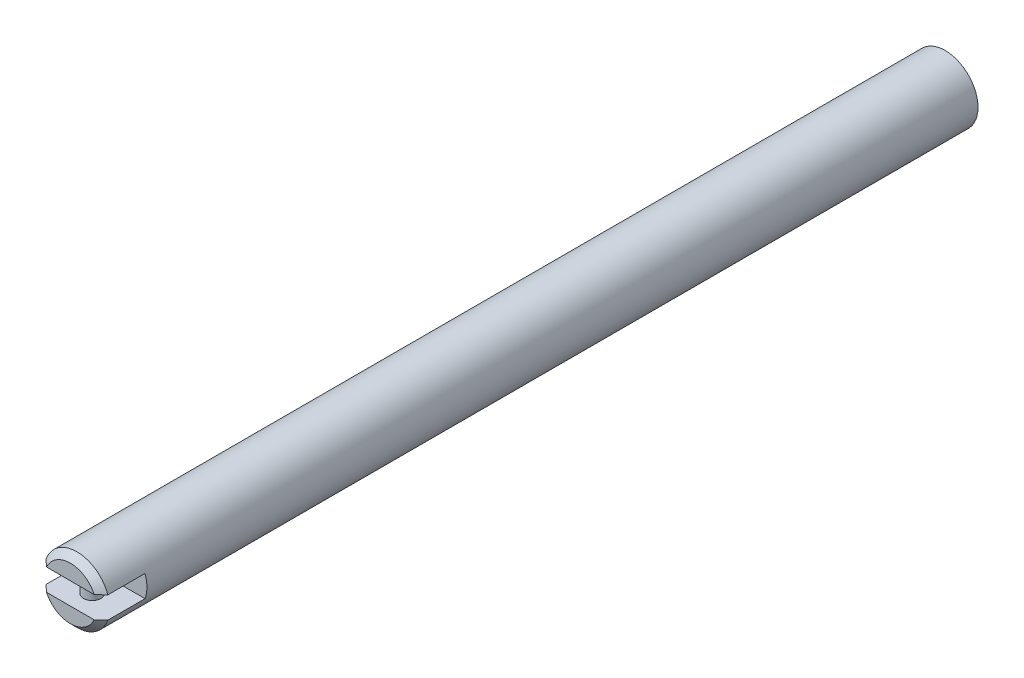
from build123d import *

# Parameters (mm, degrees)
ESQUISSE2_R             = 15
BASE_EXTRUSION_DEPTH    = 400
ENL_V_START             = -20
ENL_V_MAT_EXTRU_1_DEPTH = 20
BOSS_EXTRU_1_REACH      = 402.78
ESQUISSE4_R             = 4
CHANFREIN1_SIZE         = 3


with BuildPart() as part:
    # Esquisse2 → Base-Extrusion (new body)
    with BuildSketch(Plane.XY):
        Circle(ESQUISSE2_R)
    extrude(amount=BASE_EXTRUSION_DEPTH)

    # Esquisse3 → Enl_v. mat.-Extru.1 (cut)
    with BuildSketch(Plane.XY.offset(400).offset(ENL_V_START)):
        with BuildLine():
            Line((-14.142135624, 5), (14.142135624, 5))
            ThreePointArc((14.142135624, 5), (15, 0), (14.142135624, -5))
            Line((14.142135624, -5), (-14.142135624, -5))
            ThreePointArc((-14.142135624, -5), (-15, 0), (-14.142135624, 5))
        make_face()
    extrude(amount=ENL_V_MAT_EXTRU_1_DEPTH, mode=Mode.SUBTRACT)

    # Esquisse4 → Boss.-Extru.1 (add, up to next)
    with BuildSketch(Plane(origin=(0, -5, 0), x_dir=(-1, 0, 0), z_dir=(0, 1, 0)), mode=Mode.PRIVATE) as boss_extru_1_sk1:
        with Locations(Location((0, 390, 0), (0, 0, 270))):
            Circle(ESQUISSE4_R)
    boss_extru_1_tool1 = extrude(boss_extru_1_sk1.sketch, amount=BOSS_EXTRU_1_REACH, mode=Mode.PRIVATE) - part.part
    add(boss_extru_1_tool1.solids().sort_by_distance((0, -5, 390))[0])

    # Chanfrein1
    chanfrein1_edges = [part.edges().sort_by_distance(p)[0] for p in [
        (0, 15, 400),
        (0, -15, 400),
    ]]
    chamfer(chanfrein1_edges, length=CHANFREIN1_SIZE)


solid = part.part
